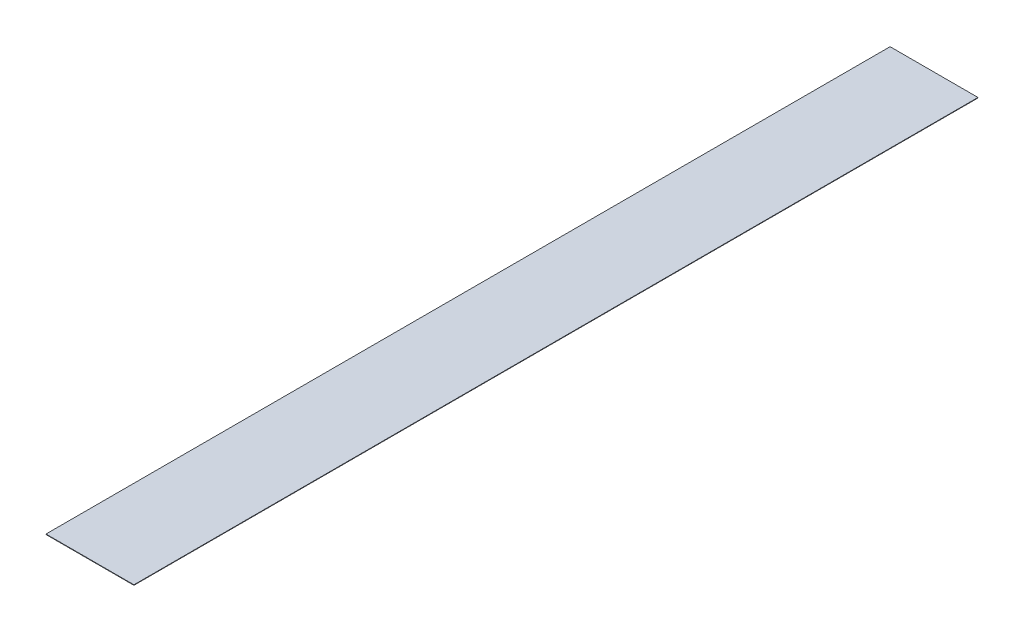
from build123d import *

# Parameters (mm, degrees)
SKETCH1_W           = 47.625
SKETCH1_H           = 457.2
BOSS_EXTRUDE1_DEPTH = 0.254


with BuildPart() as part:
    # Sketch1 → Boss-Extrude1 (new body)
    with BuildSketch(Plane(origin=(0, 0, 0), x_dir=(1, 0, 0), z_dir=(0, 1, 0))):
        Rectangle(SKETCH1_W, SKETCH1_H)
    extrude(amount=BOSS_EXTRUDE1_DEPTH)


solid = part.part
